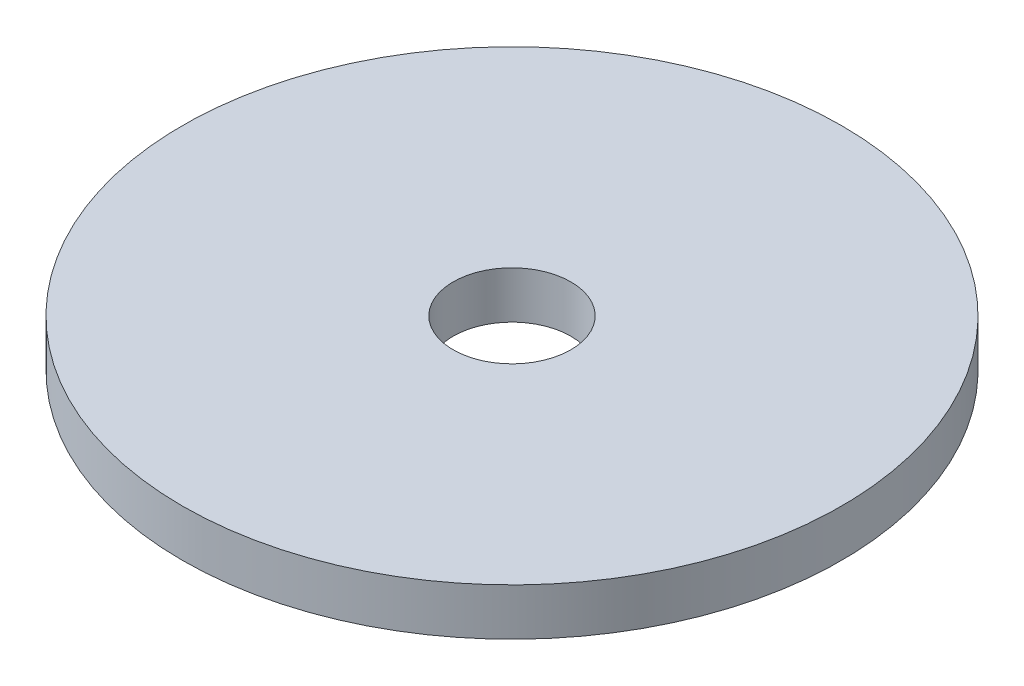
from build123d import *

# Parameters (mm, degrees)
SKETCH1_W = 11.5
SKETCH1_H = 2


with BuildPart() as part:
    # Sketch1 → Revolve1 (revolve)
    with BuildSketch(Plane.XY, mode=Mode.PRIVATE) as revolve1_sk:
        with Locations((8.25, 1)):
            Rectangle(SKETCH1_W, SKETCH1_H)
    revolve(revolve1_sk.sketch.rotate(Axis((0, 0, 0), (0, 1, 0)), 90), axis=Axis((0, 0, 0), (0, 1, 0)))


solid = part.part
